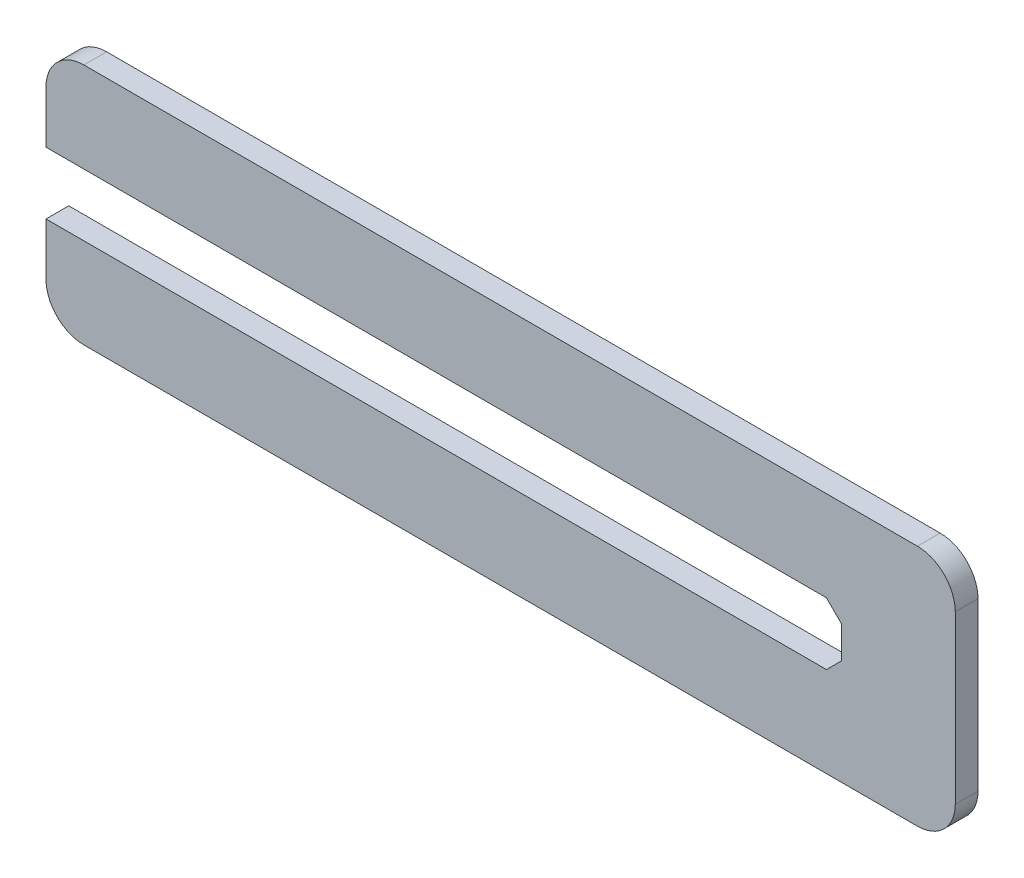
from build123d import *

# Parameters (mm, degrees)
ESQUISSE1_W      = 120
ESQUISSE1_H      = 32
EXTRUSION1_DEPTH = 3
ESQUISSE2_W      = 105
ESQUISSE2_H      = 8.2
EXTRUSION2_DEPTH = 3
CHANFREIN1_SIZE  = 2
CONG_1_R         = 5


with BuildPart() as part:
    # Esquisse1 → Extrusion1 (new body)
    with BuildSketch(Plane.XY):
        with Locations((60, 16)):
            Rectangle(ESQUISSE1_W, ESQUISSE1_H)
    extrude(amount=EXTRUSION1_DEPTH)

    # Esquisse2 → Extrusion2 (cut)
    with BuildSketch(Plane.XY.offset(3)):
        with Locations((52.5, 16)):
            Rectangle(ESQUISSE2_W, ESQUISSE2_H)
    extrude(amount=-EXTRUSION2_DEPTH, mode=Mode.SUBTRACT)

    # Chanfrein1
    chanfrein1_edges = [part.edges().sort_by_distance(p)[0] for p in [
        (105, 20.1, 1.5),
        (105, 11.9, 1.5),
    ]]
    chamfer(chanfrein1_edges, length=CHANFREIN1_SIZE)

    # Cong_1
    cong_1_edges = [part.edges().sort_by_distance(p)[0] for p in [
        (0, 32, 1.5),
        (120, 32, 1.5),
        (120, 0, 1.5),
        (0, 0, 1.5),
    ]]
    fillet(cong_1_edges, radius=CONG_1_R)


solid = part.part
